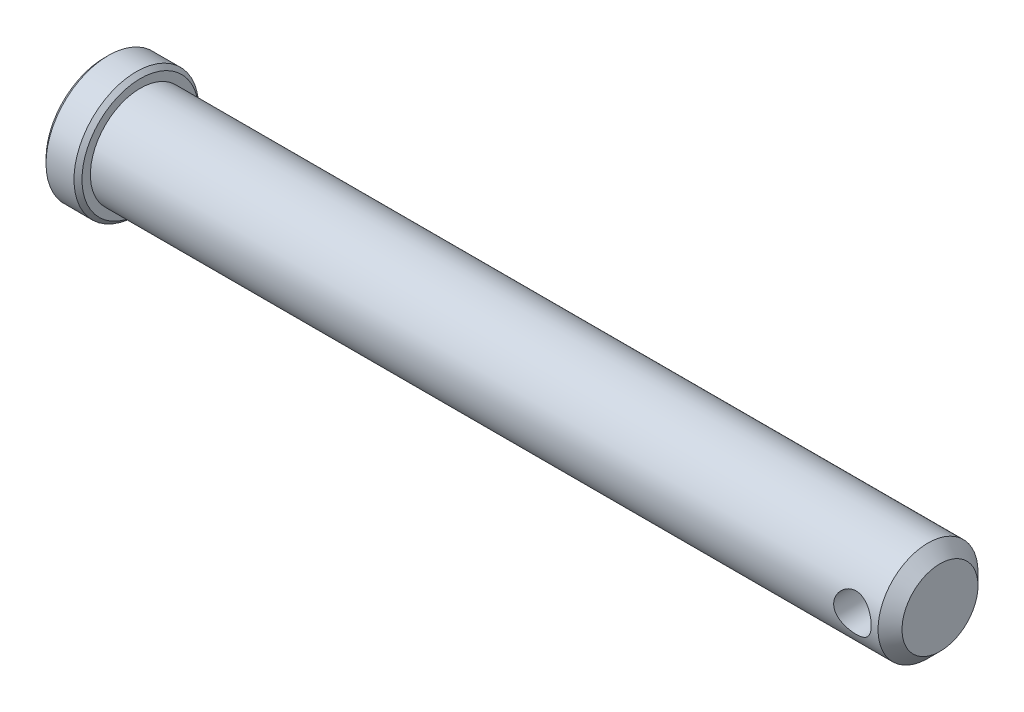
from build123d import *

# Parameters (mm, degrees)
CUT_EXTRUDE1_DEPTH      = 54.380938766
CUT_EXTRUDE1_DEPTH_BACK = 54.380938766
SKETCH2_R               = 1.1938
CHAMFER1_SIZE           = 0.762
CHAMFER2_SIZE           = 0.254


with BuildPart() as part:
    # Sketch1 → Base-Revolve (revolve)
    with BuildSketch(Plane.XY, mode=Mode.PRIVATE) as base_revolve_sk:
        Polygon((0, 0), (0, 3.9624), (2.286, 3.9624), (2.286, 3.175), (53.086, 3.175), (53.086, 0), align=None)
    revolve(base_revolve_sk.sketch.rotate(Axis((0, 0, 0), (-1, 0, 0)), 90), axis=Axis((0, 0, 0), (-1, 0, 0)))

    # Sketch2 → Cut-Extrude1 (cut, two sides: drawn at the far end of the back side and taken through both)
    with BuildSketch(Plane.XY.offset(-CUT_EXTRUDE1_DEPTH_BACK)):
        with Locations((50.6984, 0)):
            Circle(SKETCH2_R)
    extrude(amount=CUT_EXTRUDE1_DEPTH + CUT_EXTRUDE1_DEPTH_BACK, mode=Mode.SUBTRACT)

    # Chamfer1
    chamfer1_edges = [part.edges().sort_by_distance(p)[0] for p in [
        (53.086, 0, 3.175),
    ]]
    chamfer(chamfer1_edges, length=CHAMFER1_SIZE)

    # Chamfer2
    chamfer2_edges = [part.edges().sort_by_distance(p)[0] for p in [
        (2.286, 0, 3.9624),
        (0, 0, 3.9624),
    ]]
    chamfer(chamfer2_edges, length=CHAMFER2_SIZE)


solid = part.part
